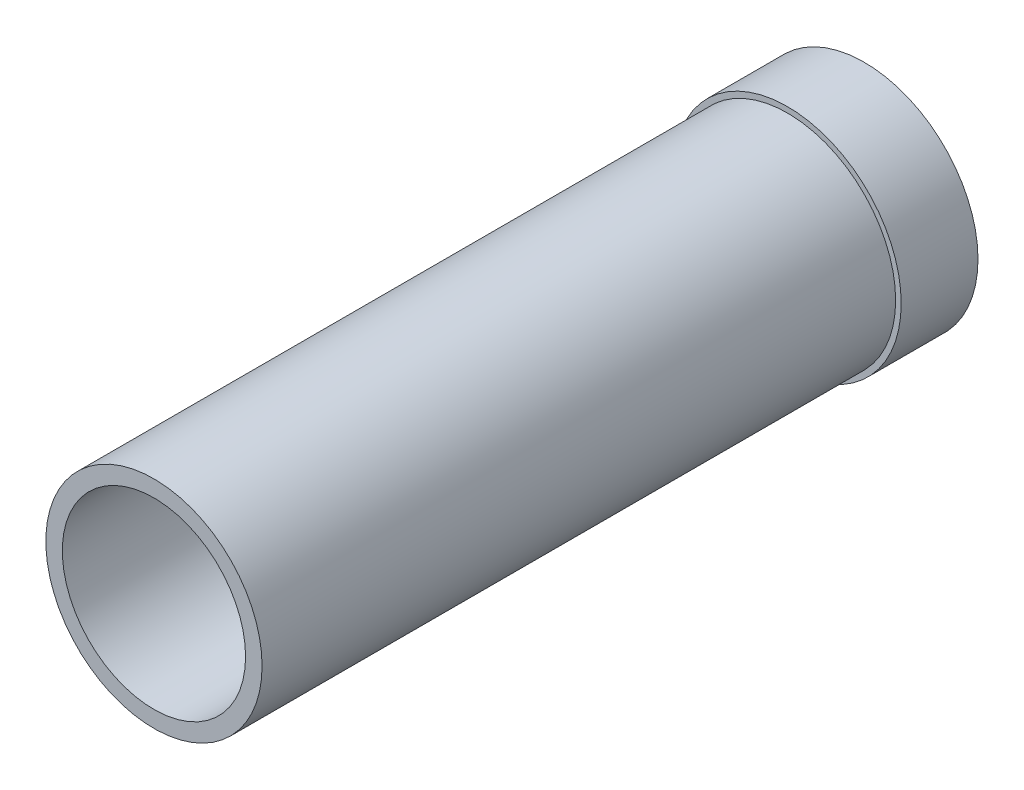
from build123d import *

# Parameters (mm, degrees)
SKETCH1_R          = 13.589
SKETCH1_R_2        = 11.51636
EXTRUDE1_DEPTH     = 89.281
SKETCH2_R          = 14.2875
EXTRUDE2_DEPTH     = 9.652
SKETCH3_R          = 3.175
EXTRUDE3_DEPTH     = 7.366
SKETCH5_R          = 0.9652
CUT_EXTRUDE1_DEPTH = 99.736558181


with BuildPart() as part:
    # Sketch1 → Extrude1 (new body)
    with BuildSketch(Plane.XY):
        Circle(SKETCH1_R)
        Circle(SKETCH1_R_2, mode=Mode.SUBTRACT)
    extrude(amount=EXTRUDE1_DEPTH)

    # Sketch2 → Extrude2 (add)
    with BuildSketch(Plane.XY):
        Circle(SKETCH2_R)
    extrude(amount=EXTRUDE2_DEPTH)

    # Sketch3 → Extrude3 (add)
    with BuildSketch(Plane(origin=(0, 0, 0), x_dir=(-1, 0, 0), z_dir=(0, 0, -1))):
        with Locations(Location((0, 0, 0), (0, 0, 180))):
            Circle(SKETCH3_R)
    extrude(amount=EXTRUDE3_DEPTH)

    # Sketch5 → Cut-Extrude1 (cut, through all)
    with BuildSketch(Plane(origin=(0, 0, -7.366), x_dir=(-1, 0, 0), z_dir=(0, 0, -1))):
        Circle(SKETCH5_R)
    extrude(amount=-CUT_EXTRUDE1_DEPTH, mode=Mode.SUBTRACT)


solid = part.part
